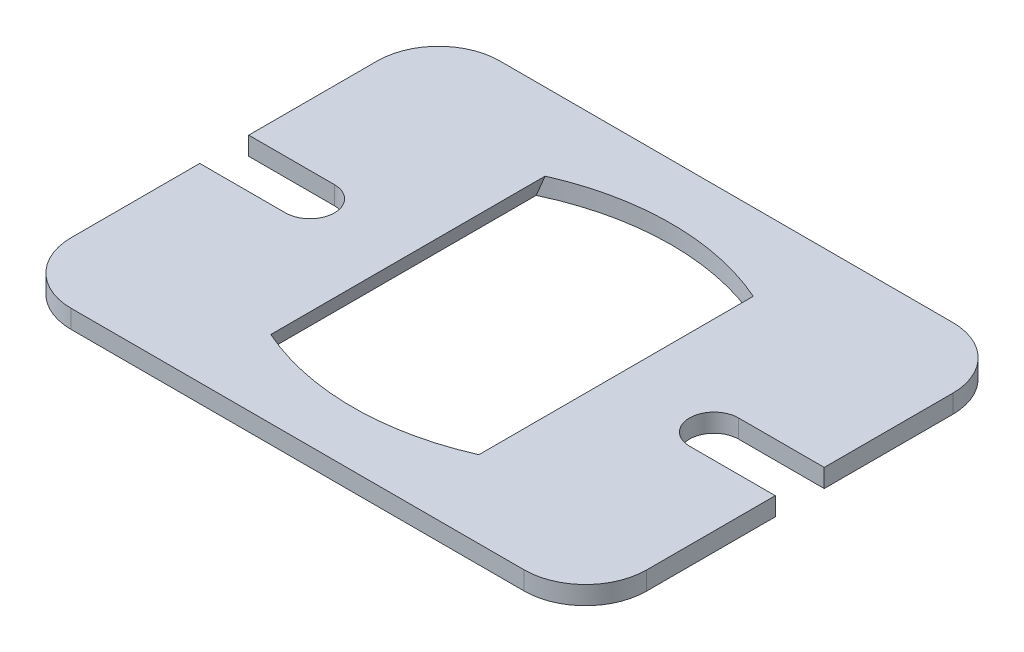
ISO-10303-21;
HEADER;
FILE_DESCRIPTION(('STEP AP214'),'2;1');
FILE_NAME('part.step','',(''),(''),'','','');
FILE_SCHEMA(('AUTOMOTIVE_DESIGN { 1 0 10303 214 1 1 1 1 }'));
ENDSEC;
DATA;
#1=APPLICATION_CONTEXT('core data for automotive mechanical design processes');
#2=APPLICATION_PROTOCOL_DEFINITION('international standard','automotive_design',2000,#1);
#3=PRODUCT_CONTEXT('',#1,'mechanical');
#4=PRODUCT('Part','Part','',(#3));
#5=PRODUCT_RELATED_PRODUCT_CATEGORY('part','',(#4));
#6=PRODUCT_DEFINITION_FORMATION('','',#4);
#7=PRODUCT_DEFINITION_CONTEXT('part definition',#1,'design');
#8=PRODUCT_DEFINITION('design','',#6,#7);
#9=PRODUCT_DEFINITION_SHAPE('','',#8);
#10=(LENGTH_UNIT() NAMED_UNIT(*) SI_UNIT(.MILLI.,.METRE.));
#11=(NAMED_UNIT(*) PLANE_ANGLE_UNIT() SI_UNIT($,.RADIAN.));
#12=(NAMED_UNIT(*) SI_UNIT($,.STERADIAN.) SOLID_ANGLE_UNIT());
#13=UNCERTAINTY_MEASURE_WITH_UNIT(LENGTH_MEASURE(1.E-05),#10,'distance_accuracy_value','');
#14=(GEOMETRIC_REPRESENTATION_CONTEXT(3) GLOBAL_UNCERTAINTY_ASSIGNED_CONTEXT((#13)) GLOBAL_UNIT_ASSIGNED_CONTEXT((#10,
#11,#12)) REPRESENTATION_CONTEXT('',''));
#15=CARTESIAN_POINT('',(0.,0.,0.));
#16=DIRECTION('',(0.,0.,1.));
#17=DIRECTION('',(1.,0.,0.));
#18=AXIS2_PLACEMENT_3D('',#15,#16,#17);
#19=CARTESIAN_POINT('',(14.,3.,-35.));
#20=DIRECTION('',(0.,1.,0.));
#21=DIRECTION('',(0.,0.,1.));
#22=AXIS2_PLACEMENT_3D('',#19,#20,#21);
#23=PLANE('',#22);
#24=DIRECTION('',(-1.,0.,0.));
#25=VECTOR('',#24,1.);
#26=CARTESIAN_POINT('',(0.,3.,-70.));
#27=LINE('',#26,#25);
#28=CARTESIAN_POINT('',(84.,3.,-70.));
#29=VERTEX_POINT('',#28);
#30=CARTESIAN_POINT('',(10.,3.,-70.));
#31=VERTEX_POINT('',#30);
#32=EDGE_CURVE('E332',#29,#31,#27,.T.);
#33=ORIENTED_EDGE('',*,*,#32,.T.);
#34=CARTESIAN_POINT('',(10.,3.,-60.));
#35=DIRECTION('',(0.,1.,0.));
#36=DIRECTION('',(0.,0.,1.));
#37=AXIS2_PLACEMENT_3D('',#34,#35,#36);
#38=CIRCLE('',#37,10.);
#39=CARTESIAN_POINT('',(0.,3.,-60.));
#40=VERTEX_POINT('',#39);
#41=EDGE_CURVE('E220',#31,#40,#38,.T.);
#42=ORIENTED_EDGE('',*,*,#41,.T.);
#43=DIRECTION('',(0.,0.,1.));
#44=VECTOR('',#43,1.);
#45=CARTESIAN_POINT('',(0.,3.,-39.));
#46=LINE('',#45,#44);
#47=CARTESIAN_POINT('',(0.,3.,-39.));
#48=VERTEX_POINT('',#47);
#49=EDGE_CURVE('E334',#40,#48,#46,.T.);
#50=ORIENTED_EDGE('',*,*,#49,.T.);
#51=DIRECTION('',(1.,0.,0.));
#52=VECTOR('',#51,1.);
#53=CARTESIAN_POINT('',(14.,3.,-39.));
#54=LINE('',#53,#52);
#55=CARTESIAN_POINT('',(14.,3.,-39.));
#56=VERTEX_POINT('',#55);
#57=EDGE_CURVE('E336',#48,#56,#54,.T.);
#58=ORIENTED_EDGE('',*,*,#57,.T.);
#59=CARTESIAN_POINT('',(14.,3.,-35.));
#60=DIRECTION('',(0.,-1.,0.));
#61=DIRECTION('',(0.,0.,1.));
#62=AXIS2_PLACEMENT_3D('',#59,#60,#61);
#63=CIRCLE('',#62,4.00000000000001);
#64=CARTESIAN_POINT('',(14.,3.,-31.));
#65=VERTEX_POINT('',#64);
#66=EDGE_CURVE('E338',#56,#65,#63,.T.);
#67=ORIENTED_EDGE('',*,*,#66,.T.);
#68=DIRECTION('',(-1.,0.,0.));
#69=VECTOR('',#68,1.);
#70=CARTESIAN_POINT('',(14.,3.,-31.));
#71=LINE('',#70,#69);
#72=CARTESIAN_POINT('',(0.,3.,-31.));
#73=VERTEX_POINT('',#72);
#74=EDGE_CURVE('E286',#65,#73,#71,.T.);
#75=ORIENTED_EDGE('',*,*,#74,.T.);
#76=DIRECTION('',(0.,0.,1.));
#77=VECTOR('',#76,1.);
#78=CARTESIAN_POINT('',(0.,3.,0.));
#79=LINE('',#78,#77);
#80=CARTESIAN_POINT('',(0.,3.,-10.));
#81=VERTEX_POINT('',#80);
#82=EDGE_CURVE('E242',#73,#81,#79,.T.);
#83=ORIENTED_EDGE('',*,*,#82,.T.);
#84=CARTESIAN_POINT('',(10.,3.,-10.));
#85=DIRECTION('',(0.,1.,0.));
#86=DIRECTION('',(0.,0.,1.));
#87=AXIS2_PLACEMENT_3D('',#84,#85,#86);
#88=CIRCLE('',#87,10.);
#89=CARTESIAN_POINT('',(10.,3.,0.));
#90=VERTEX_POINT('',#89);
#91=EDGE_CURVE('E215',#81,#90,#88,.T.);
#92=ORIENTED_EDGE('',*,*,#91,.T.);
#93=DIRECTION('',(1.,0.,0.));
#94=VECTOR('',#93,1.);
#95=CARTESIAN_POINT('',(0.,3.,0.));
#96=LINE('',#95,#94);
#97=CARTESIAN_POINT('',(84.,3.,0.));
#98=VERTEX_POINT('',#97);
#99=EDGE_CURVE('E233',#90,#98,#96,.T.);
#100=ORIENTED_EDGE('',*,*,#99,.T.);
#101=CARTESIAN_POINT('',(84.,3.,-10.));
#102=DIRECTION('',(0.,1.,0.));
#103=DIRECTION('',(0.,0.,1.));
#104=AXIS2_PLACEMENT_3D('',#101,#102,#103);
#105=CIRCLE('',#104,10.);
#106=CARTESIAN_POINT('',(94.,3.,-9.99999999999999));
#107=VERTEX_POINT('',#106);
#108=EDGE_CURVE('E54',#98,#107,#105,.T.);
#109=ORIENTED_EDGE('',*,*,#108,.T.);
#110=DIRECTION('',(0.,0.,-1.));
#111=VECTOR('',#110,1.);
#112=CARTESIAN_POINT('',(94.,3.,0.));
#113=LINE('',#112,#111);
#114=CARTESIAN_POINT('',(94.,3.,-31.));
#115=VERTEX_POINT('',#114);
#116=EDGE_CURVE('E241',#107,#115,#113,.T.);
#117=ORIENTED_EDGE('',*,*,#116,.T.);
#118=DIRECTION('',(-1.,0.,0.));
#119=VECTOR('',#118,1.);
#120=CARTESIAN_POINT('',(80.,3.,-31.));
#121=LINE('',#120,#119);
#122=CARTESIAN_POINT('',(80.,3.,-31.));
#123=VERTEX_POINT('',#122);
#124=EDGE_CURVE('E324',#115,#123,#121,.T.);
#125=ORIENTED_EDGE('',*,*,#124,.T.);
#126=CARTESIAN_POINT('',(80.,3.,-35.));
#127=DIRECTION('',(0.,-1.,0.));
#128=DIRECTION('',(0.,0.,1.));
#129=AXIS2_PLACEMENT_3D('',#126,#127,#128);
#130=CIRCLE('',#129,4.);
#131=CARTESIAN_POINT('',(80.,3.,-39.));
#132=VERTEX_POINT('',#131);
#133=EDGE_CURVE('E326',#123,#132,#130,.T.);
#134=ORIENTED_EDGE('',*,*,#133,.T.);
#135=DIRECTION('',(1.,0.,0.));
#136=VECTOR('',#135,1.);
#137=CARTESIAN_POINT('',(80.,3.,-39.));
#138=LINE('',#137,#136);
#139=CARTESIAN_POINT('',(94.,3.,-39.));
#140=VERTEX_POINT('',#139);
#141=EDGE_CURVE('E328',#132,#140,#138,.T.);
#142=ORIENTED_EDGE('',*,*,#141,.T.);
#143=DIRECTION('',(0.,0.,-1.));
#144=VECTOR('',#143,1.);
#145=CARTESIAN_POINT('',(94.,3.,-39.));
#146=LINE('',#145,#144);
#147=CARTESIAN_POINT('',(94.,3.,-60.));
#148=VERTEX_POINT('',#147);
#149=EDGE_CURVE('E330',#140,#148,#146,.T.);
#150=ORIENTED_EDGE('',*,*,#149,.T.);
#151=CARTESIAN_POINT('',(84.,3.,-60.));
#152=DIRECTION('',(0.,1.,0.));
#153=DIRECTION('',(0.,0.,1.));
#154=AXIS2_PLACEMENT_3D('',#151,#152,#153);
#155=CIRCLE('',#154,10.);
#156=EDGE_CURVE('E218',#148,#29,#155,.T.);
#157=ORIENTED_EDGE('',*,*,#156,.T.);
#158=EDGE_LOOP('',(#33,#42,#50,#58,#67,#75,#83,#92,#100,#109,#117,#125,#134,#142,#150,#157));
#159=FACE_BOUND('',#158,.T.);
#160=DIRECTION('',(0.,0.,1.));
#161=VECTOR('',#160,1.);
#162=CARTESIAN_POINT('',(30.,3.,-57.405728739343));
#163=LINE('',#162,#161);
#164=CARTESIAN_POINT('',(30.,3.,-57.405728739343));
#165=VERTEX_POINT('',#164);
#166=CARTESIAN_POINT('',(30.,3.,-12.594271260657));
#167=VERTEX_POINT('',#166);
#168=EDGE_CURVE('E181',#165,#167,#163,.T.);
#169=ORIENTED_EDGE('',*,*,#168,.F.);
#170=CARTESIAN_POINT('',(47.,3.,-19.));
#171=DIRECTION('',(0.,1.,0.));
#172=DIRECTION('',(0.,0.,1.));
#173=AXIS2_PLACEMENT_3D('',#170,#171,#172);
#174=CIRCLE('',#173,42.);
#175=CARTESIAN_POINT('',(64.,3.,-57.405728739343));
#176=VERTEX_POINT('',#175);
#177=EDGE_CURVE('E170',#176,#165,#174,.T.);
#178=ORIENTED_EDGE('',*,*,#177,.F.);
#179=DIRECTION('',(0.,0.,-1.));
#180=VECTOR('',#179,1.);
#181=CARTESIAN_POINT('',(64.,3.,-57.405728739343));
#182=LINE('',#181,#180);
#183=CARTESIAN_POINT('',(64.,3.,-12.594271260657));
#184=VERTEX_POINT('',#183);
#185=EDGE_CURVE('E341',#184,#176,#182,.T.);
#186=ORIENTED_EDGE('',*,*,#185,.F.);
#187=CARTESIAN_POINT('',(47.,3.,-51.));
#188=DIRECTION('',(0.,1.,0.));
#189=DIRECTION('',(0.,0.,1.));
#190=AXIS2_PLACEMENT_3D('',#187,#188,#189);
#191=CIRCLE('',#190,42.);
#192=EDGE_CURVE('E186',#167,#184,#191,.T.);
#193=ORIENTED_EDGE('',*,*,#192,.F.);
#194=EDGE_LOOP('',(#169,#178,#186,#193));
#195=FACE_BOUND('',#194,.T.);
#196=ADVANCED_FACE('F31',(#159,#195),#23,.T.);
#197=CARTESIAN_POINT('',(14.,0.,-35.));
#198=DIRECTION('',(0.,1.,0.));
#199=DIRECTION('',(0.,0.,1.));
#200=AXIS2_PLACEMENT_3D('',#197,#198,#199);
#201=PLANE('',#200);
#202=DIRECTION('',(0.,0.,1.));
#203=VECTOR('',#202,1.);
#204=CARTESIAN_POINT('',(0.,0.,-39.));
#205=LINE('',#204,#203);
#206=CARTESIAN_POINT('',(0.,0.,-60.));
#207=VERTEX_POINT('',#206);
#208=CARTESIAN_POINT('',(0.,0.,-39.));
#209=VERTEX_POINT('',#208);
#210=EDGE_CURVE('E274',#207,#209,#205,.T.);
#211=ORIENTED_EDGE('',*,*,#210,.F.);
#212=CARTESIAN_POINT('',(10.,0.,-60.));
#213=DIRECTION('',(0.,1.,0.));
#214=DIRECTION('',(0.,0.,1.));
#215=AXIS2_PLACEMENT_3D('',#212,#213,#214);
#216=CIRCLE('',#215,10.);
#217=CARTESIAN_POINT('',(10.,0.,-70.));
#218=VERTEX_POINT('',#217);
#219=EDGE_CURVE('E208',#207,#218,#216,.F.);
#220=ORIENTED_EDGE('',*,*,#219,.T.);
#221=DIRECTION('',(-1.,0.,0.));
#222=VECTOR('',#221,1.);
#223=CARTESIAN_POINT('',(0.,0.,-70.));
#224=LINE('',#223,#222);
#225=CARTESIAN_POINT('',(84.,0.,-70.));
#226=VERTEX_POINT('',#225);
#227=EDGE_CURVE('E271',#226,#218,#224,.T.);
#228=ORIENTED_EDGE('',*,*,#227,.F.);
#229=CARTESIAN_POINT('',(84.,0.,-60.));
#230=DIRECTION('',(0.,1.,0.));
#231=DIRECTION('',(0.,0.,1.));
#232=AXIS2_PLACEMENT_3D('',#229,#230,#231);
#233=CIRCLE('',#232,10.);
#234=CARTESIAN_POINT('',(94.,0.,-60.));
#235=VERTEX_POINT('',#234);
#236=EDGE_CURVE('E206',#226,#235,#233,.F.);
#237=ORIENTED_EDGE('',*,*,#236,.T.);
#238=DIRECTION('',(0.,0.,-1.));
#239=VECTOR('',#238,1.);
#240=CARTESIAN_POINT('',(94.,0.,-39.));
#241=LINE('',#240,#239);
#242=CARTESIAN_POINT('',(94.,0.,-39.));
#243=VERTEX_POINT('',#242);
#244=EDGE_CURVE('E269',#243,#235,#241,.T.);
#245=ORIENTED_EDGE('',*,*,#244,.F.);
#246=DIRECTION('',(1.,0.,0.));
#247=VECTOR('',#246,1.);
#248=CARTESIAN_POINT('',(80.,0.,-39.));
#249=LINE('',#248,#247);
#250=CARTESIAN_POINT('',(80.,0.,-39.));
#251=VERTEX_POINT('',#250);
#252=EDGE_CURVE('E267',#251,#243,#249,.T.);
#253=ORIENTED_EDGE('',*,*,#252,.F.);
#254=CARTESIAN_POINT('',(80.,0.,-35.));
#255=DIRECTION('',(0.,-1.,0.));
#256=DIRECTION('',(0.,0.,1.));
#257=AXIS2_PLACEMENT_3D('',#254,#255,#256);
#258=CIRCLE('',#257,4.);
#259=CARTESIAN_POINT('',(80.,0.,-31.));
#260=VERTEX_POINT('',#259);
#261=EDGE_CURVE('E260',#260,#251,#258,.T.);
#262=ORIENTED_EDGE('',*,*,#261,.F.);
#263=DIRECTION('',(-1.,0.,0.));
#264=VECTOR('',#263,1.);
#265=CARTESIAN_POINT('',(80.,0.,-31.));
#266=LINE('',#265,#264);
#267=CARTESIAN_POINT('',(94.,0.,-31.));
#268=VERTEX_POINT('',#267);
#269=EDGE_CURVE('E258',#268,#260,#266,.T.);
#270=ORIENTED_EDGE('',*,*,#269,.F.);
#271=DIRECTION('',(0.,0.,-1.));
#272=VECTOR('',#271,1.);
#273=CARTESIAN_POINT('',(94.,0.,0.));
#274=LINE('',#273,#272);
#275=CARTESIAN_POINT('',(94.,0.,-9.99999999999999));
#276=VERTEX_POINT('',#275);
#277=EDGE_CURVE('E250',#276,#268,#274,.T.);
#278=ORIENTED_EDGE('',*,*,#277,.F.);
#279=CARTESIAN_POINT('',(84.,0.,-10.));
#280=DIRECTION('',(0.,1.,0.));
#281=DIRECTION('',(0.,0.,1.));
#282=AXIS2_PLACEMENT_3D('',#279,#280,#281);
#283=CIRCLE('',#282,10.);
#284=CARTESIAN_POINT('',(84.,0.,0.));
#285=VERTEX_POINT('',#284);
#286=EDGE_CURVE('E204',#276,#285,#283,.F.);
#287=ORIENTED_EDGE('',*,*,#286,.T.);
#288=DIRECTION('',(1.,0.,0.));
#289=VECTOR('',#288,1.);
#290=CARTESIAN_POINT('',(0.,0.,0.));
#291=LINE('',#290,#289);
#292=CARTESIAN_POINT('',(10.,0.,0.));
#293=VERTEX_POINT('',#292);
#294=EDGE_CURVE('E236',#293,#285,#291,.T.);
#295=ORIENTED_EDGE('',*,*,#294,.F.);
#296=CARTESIAN_POINT('',(10.,0.,-10.));
#297=DIRECTION('',(0.,1.,0.));
#298=DIRECTION('',(0.,0.,1.));
#299=AXIS2_PLACEMENT_3D('',#296,#297,#298);
#300=CIRCLE('',#299,10.);
#301=CARTESIAN_POINT('',(0.,0.,-10.));
#302=VERTEX_POINT('',#301);
#303=EDGE_CURVE('E197',#293,#302,#300,.F.);
#304=ORIENTED_EDGE('',*,*,#303,.T.);
#305=DIRECTION('',(0.,0.,1.));
#306=VECTOR('',#305,1.);
#307=CARTESIAN_POINT('',(0.,0.,0.));
#308=LINE('',#307,#306);
#309=CARTESIAN_POINT('',(0.,0.,-31.));
#310=VERTEX_POINT('',#309);
#311=EDGE_CURVE('E262',#310,#302,#308,.T.);
#312=ORIENTED_EDGE('',*,*,#311,.F.);
#313=DIRECTION('',(-1.,0.,0.));
#314=VECTOR('',#313,1.);
#315=CARTESIAN_POINT('',(14.,0.,-31.));
#316=LINE('',#315,#314);
#317=CARTESIAN_POINT('',(14.,0.,-31.));
#318=VERTEX_POINT('',#317);
#319=EDGE_CURVE('E280',#318,#310,#316,.T.);
#320=ORIENTED_EDGE('',*,*,#319,.F.);
#321=CARTESIAN_POINT('',(14.,0.,-35.));
#322=DIRECTION('',(0.,-1.,0.));
#323=DIRECTION('',(0.,0.,1.));
#324=AXIS2_PLACEMENT_3D('',#321,#322,#323);
#325=CIRCLE('',#324,4.00000000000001);
#326=CARTESIAN_POINT('',(14.,0.,-39.));
#327=VERTEX_POINT('',#326);
#328=EDGE_CURVE('E278',#327,#318,#325,.T.);
#329=ORIENTED_EDGE('',*,*,#328,.F.);
#330=DIRECTION('',(1.,0.,0.));
#331=VECTOR('',#330,1.);
#332=CARTESIAN_POINT('',(14.,0.,-39.));
#333=LINE('',#332,#331);
#334=EDGE_CURVE('E276',#209,#327,#333,.T.);
#335=ORIENTED_EDGE('',*,*,#334,.F.);
#336=EDGE_LOOP('',(#211,#220,#228,#237,#245,#253,#262,#270,#278,#287,#295,#304,#312,#320,#329,#335));
#337=FACE_BOUND('',#336,.T.);
#338=DIRECTION('',(0.,0.,-1.));
#339=VECTOR('',#338,1.);
#340=CARTESIAN_POINT('',(65.,0.,-57.405728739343));
#341=LINE('',#340,#339);
#342=CARTESIAN_POINT('',(65.,0.,-13.0526680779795));
#343=VERTEX_POINT('',#342);
#344=CARTESIAN_POINT('',(65.,0.,-56.9473319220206));
#345=VERTEX_POINT('',#344);
#346=EDGE_CURVE('E307',#343,#345,#341,.T.);
#347=ORIENTED_EDGE('',*,*,#346,.T.);
#348=CARTESIAN_POINT('',(47.,0.,-19.));
#349=DIRECTION('',(0.,1.,0.));
#350=DIRECTION('',(0.,0.,1.));
#351=AXIS2_PLACEMENT_3D('',#348,#349,#350);
#352=CIRCLE('',#351,42.);
#353=CARTESIAN_POINT('',(29.,0.,-56.9473319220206));
#354=VERTEX_POINT('',#353);
#355=EDGE_CURVE('E317',#345,#354,#352,.T.);
#356=ORIENTED_EDGE('',*,*,#355,.T.);
#357=DIRECTION('',(0.,0.,1.));
#358=VECTOR('',#357,1.);
#359=CARTESIAN_POINT('',(29.,0.,-12.594271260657));
#360=LINE('',#359,#358);
#361=CARTESIAN_POINT('',(29.,0.,-13.0526680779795));
#362=VERTEX_POINT('',#361);
#363=EDGE_CURVE('E192',#354,#362,#360,.T.);
#364=ORIENTED_EDGE('',*,*,#363,.T.);
#365=CARTESIAN_POINT('',(47.,0.,-51.));
#366=DIRECTION('',(0.,1.,0.));
#367=DIRECTION('',(0.,0.,1.));
#368=AXIS2_PLACEMENT_3D('',#365,#366,#367);
#369=CIRCLE('',#368,42.);
#370=EDGE_CURVE('E182',#362,#343,#369,.T.);
#371=ORIENTED_EDGE('',*,*,#370,.T.);
#372=EDGE_LOOP('',(#347,#356,#364,#371));
#373=FACE_BOUND('',#372,.T.);
#374=ADVANCED_FACE('F255',(#337,#373),#201,.F.);
#375=CARTESIAN_POINT('',(0.,3.,0.));
#376=DIRECTION('',(1.,0.,0.));
#377=DIRECTION('',(0.,0.,-1.));
#378=AXIS2_PLACEMENT_3D('',#375,#376,#377);
#379=PLANE('',#378);
#380=ORIENTED_EDGE('',*,*,#311,.T.);
#381=DIRECTION('',(0.,-1.,0.));
#382=VECTOR('',#381,1.);
#383=CARTESIAN_POINT('',(0.,3.,-10.));
#384=LINE('',#383,#382);
#385=EDGE_CURVE('E11',#302,#81,#384,.F.);
#386=ORIENTED_EDGE('',*,*,#385,.T.);
#387=ORIENTED_EDGE('',*,*,#82,.F.);
#388=DIRECTION('',(0.,-1.,0.));
#389=VECTOR('',#388,1.);
#390=CARTESIAN_POINT('',(0.,3.,-31.));
#391=LINE('',#390,#389);
#392=EDGE_CURVE('E282',#73,#310,#391,.T.);
#393=ORIENTED_EDGE('',*,*,#392,.T.);
#394=EDGE_LOOP('',(#380,#386,#387,#393));
#395=FACE_BOUND('',#394,.T.);
#396=ADVANCED_FACE('F346',(#395),#379,.F.);
#397=CARTESIAN_POINT('',(0.,3.,0.));
#398=DIRECTION('',(0.,0.,-1.));
#399=DIRECTION('',(-1.,0.,0.));
#400=AXIS2_PLACEMENT_3D('',#397,#398,#399);
#401=PLANE('',#400);
#402=ORIENTED_EDGE('',*,*,#294,.T.);
#403=DIRECTION('',(0.,-1.,0.));
#404=VECTOR('',#403,1.);
#405=CARTESIAN_POINT('',(84.,3.,0.));
#406=LINE('',#405,#404);
#407=EDGE_CURVE('E39',#285,#98,#406,.F.);
#408=ORIENTED_EDGE('',*,*,#407,.T.);
#409=ORIENTED_EDGE('',*,*,#99,.F.);
#410=DIRECTION('',(0.,-1.,0.));
#411=VECTOR('',#410,1.);
#412=CARTESIAN_POINT('',(10.,3.,0.));
#413=LINE('',#412,#411);
#414=EDGE_CURVE('E226',#90,#293,#413,.T.);
#415=ORIENTED_EDGE('',*,*,#414,.T.);
#416=EDGE_LOOP('',(#402,#408,#409,#415));
#417=FACE_BOUND('',#416,.T.);
#418=ADVANCED_FACE('F232',(#417),#401,.F.);
#419=CARTESIAN_POINT('',(94.,3.,0.));
#420=DIRECTION('',(-1.,0.,0.));
#421=DIRECTION('',(0.,0.,1.));
#422=AXIS2_PLACEMENT_3D('',#419,#420,#421);
#423=PLANE('',#422);
#424=ORIENTED_EDGE('',*,*,#116,.F.);
#425=DIRECTION('',(0.,-1.,0.));
#426=VECTOR('',#425,1.);
#427=CARTESIAN_POINT('',(94.,3.,-9.99999999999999));
#428=LINE('',#427,#426);
#429=EDGE_CURVE('E223',#107,#276,#428,.T.);
#430=ORIENTED_EDGE('',*,*,#429,.T.);
#431=ORIENTED_EDGE('',*,*,#277,.T.);
#432=DIRECTION('',(0.,-1.,0.));
#433=VECTOR('',#432,1.);
#434=CARTESIAN_POINT('',(94.,3.,-31.));
#435=LINE('',#434,#433);
#436=EDGE_CURVE('E304',#115,#268,#435,.T.);
#437=ORIENTED_EDGE('',*,*,#436,.F.);
#438=EDGE_LOOP('',(#424,#430,#431,#437));
#439=FACE_BOUND('',#438,.T.);
#440=ADVANCED_FACE('F248',(#439),#423,.F.);
#441=CARTESIAN_POINT('',(80.,3.,-31.));
#442=DIRECTION('',(0.,0.,1.));
#443=DIRECTION('',(1.,0.,0.));
#444=AXIS2_PLACEMENT_3D('',#441,#442,#443);
#445=PLANE('',#444);
#446=ORIENTED_EDGE('',*,*,#269,.T.);
#447=DIRECTION('',(0.,-1.,0.));
#448=VECTOR('',#447,1.);
#449=CARTESIAN_POINT('',(80.,3.,-31.));
#450=LINE('',#449,#448);
#451=EDGE_CURVE('E301',#123,#260,#450,.T.);
#452=ORIENTED_EDGE('',*,*,#451,.F.);
#453=ORIENTED_EDGE('',*,*,#124,.F.);
#454=ORIENTED_EDGE('',*,*,#436,.T.);
#455=EDGE_LOOP('',(#446,#452,#453,#454));
#456=FACE_BOUND('',#455,.T.);
#457=ADVANCED_FACE('F395',(#456),#445,.F.);
#458=CARTESIAN_POINT('',(80.,3.,-35.));
#459=DIRECTION('',(0.,-1.,0.));
#460=DIRECTION('',(0.,0.,-1.));
#461=AXIS2_PLACEMENT_3D('',#458,#459,#460);
#462=CYLINDRICAL_SURFACE('',#461,4.);
#463=ORIENTED_EDGE('',*,*,#261,.T.);
#464=DIRECTION('',(0.,-1.,0.));
#465=VECTOR('',#464,1.);
#466=CARTESIAN_POINT('',(80.,3.,-39.));
#467=LINE('',#466,#465);
#468=EDGE_CURVE('E298',#132,#251,#467,.T.);
#469=ORIENTED_EDGE('',*,*,#468,.F.);
#470=ORIENTED_EDGE('',*,*,#133,.F.);
#471=ORIENTED_EDGE('',*,*,#451,.T.);
#472=EDGE_LOOP('',(#463,#469,#470,#471));
#473=FACE_BOUND('',#472,.T.);
#474=ADVANCED_FACE('F391',(#473),#462,.F.);
#475=CARTESIAN_POINT('',(80.,3.,-39.));
#476=DIRECTION('',(0.,0.,-1.));
#477=DIRECTION('',(-1.,0.,0.));
#478=AXIS2_PLACEMENT_3D('',#475,#476,#477);
#479=PLANE('',#478);
#480=ORIENTED_EDGE('',*,*,#252,.T.);
#481=DIRECTION('',(0.,-1.,0.));
#482=VECTOR('',#481,1.);
#483=CARTESIAN_POINT('',(94.,3.,-39.));
#484=LINE('',#483,#482);
#485=EDGE_CURVE('E295',#140,#243,#484,.T.);
#486=ORIENTED_EDGE('',*,*,#485,.F.);
#487=ORIENTED_EDGE('',*,*,#141,.F.);
#488=ORIENTED_EDGE('',*,*,#468,.T.);
#489=EDGE_LOOP('',(#480,#486,#487,#488));
#490=FACE_BOUND('',#489,.T.);
#491=ADVANCED_FACE('F388',(#490),#479,.F.);
#492=CARTESIAN_POINT('',(94.,3.,-39.));
#493=DIRECTION('',(-1.,0.,0.));
#494=DIRECTION('',(0.,0.,1.));
#495=AXIS2_PLACEMENT_3D('',#492,#493,#494);
#496=PLANE('',#495);
#497=ORIENTED_EDGE('',*,*,#244,.T.);
#498=DIRECTION('',(0.,-1.,0.));
#499=VECTOR('',#498,1.);
#500=CARTESIAN_POINT('',(94.,3.,-60.));
#501=LINE('',#500,#499);
#502=EDGE_CURVE('E46',#235,#148,#501,.F.);
#503=ORIENTED_EDGE('',*,*,#502,.T.);
#504=ORIENTED_EDGE('',*,*,#149,.F.);
#505=ORIENTED_EDGE('',*,*,#485,.T.);
#506=EDGE_LOOP('',(#497,#503,#504,#505));
#507=FACE_BOUND('',#506,.T.);
#508=ADVANCED_FACE('F384',(#507),#496,.F.);
#509=CARTESIAN_POINT('',(0.,3.,-70.));
#510=DIRECTION('',(0.,0.,1.));
#511=DIRECTION('',(1.,0.,0.));
#512=AXIS2_PLACEMENT_3D('',#509,#510,#511);
#513=PLANE('',#512);
#514=ORIENTED_EDGE('',*,*,#227,.T.);
#515=DIRECTION('',(0.,-1.,0.));
#516=VECTOR('',#515,1.);
#517=CARTESIAN_POINT('',(10.,3.,-70.));
#518=LINE('',#517,#516);
#519=EDGE_CURVE('E213',#218,#31,#518,.F.);
#520=ORIENTED_EDGE('',*,*,#519,.T.);
#521=ORIENTED_EDGE('',*,*,#32,.F.);
#522=DIRECTION('',(0.,-1.,0.));
#523=VECTOR('',#522,1.);
#524=CARTESIAN_POINT('',(84.,3.,-70.));
#525=LINE('',#524,#523);
#526=EDGE_CURVE('E210',#29,#226,#525,.T.);
#527=ORIENTED_EDGE('',*,*,#526,.T.);
#528=EDGE_LOOP('',(#514,#520,#521,#527));
#529=FACE_BOUND('',#528,.T.);
#530=ADVANCED_FACE('F380',(#529),#513,.F.);
#531=CARTESIAN_POINT('',(0.,3.,-39.));
#532=DIRECTION('',(1.,0.,0.));
#533=DIRECTION('',(0.,0.,-1.));
#534=AXIS2_PLACEMENT_3D('',#531,#532,#533);
#535=PLANE('',#534);
#536=ORIENTED_EDGE('',*,*,#49,.F.);
#537=DIRECTION('',(0.,-1.,0.));
#538=VECTOR('',#537,1.);
#539=CARTESIAN_POINT('',(0.,3.,-60.));
#540=LINE('',#539,#538);
#541=EDGE_CURVE('E193',#40,#207,#540,.T.);
#542=ORIENTED_EDGE('',*,*,#541,.T.);
#543=ORIENTED_EDGE('',*,*,#210,.T.);
#544=DIRECTION('',(0.,-1.,0.));
#545=VECTOR('',#544,1.);
#546=CARTESIAN_POINT('',(0.,3.,-39.));
#547=LINE('',#546,#545);
#548=EDGE_CURVE('E292',#48,#209,#547,.T.);
#549=ORIENTED_EDGE('',*,*,#548,.F.);
#550=EDGE_LOOP('',(#536,#542,#543,#549));
#551=FACE_BOUND('',#550,.T.);
#552=ADVANCED_FACE('F376',(#551),#535,.F.);
#553=CARTESIAN_POINT('',(14.,3.,-39.));
#554=DIRECTION('',(0.,0.,-1.));
#555=DIRECTION('',(-1.,0.,0.));
#556=AXIS2_PLACEMENT_3D('',#553,#554,#555);
#557=PLANE('',#556);
#558=ORIENTED_EDGE('',*,*,#334,.T.);
#559=DIRECTION('',(0.,-1.,0.));
#560=VECTOR('',#559,1.);
#561=CARTESIAN_POINT('',(14.,3.,-39.));
#562=LINE('',#561,#560);
#563=EDGE_CURVE('E289',#56,#327,#562,.T.);
#564=ORIENTED_EDGE('',*,*,#563,.F.);
#565=ORIENTED_EDGE('',*,*,#57,.F.);
#566=ORIENTED_EDGE('',*,*,#548,.T.);
#567=EDGE_LOOP('',(#558,#564,#565,#566));
#568=FACE_BOUND('',#567,.T.);
#569=ADVANCED_FACE('F372',(#568),#557,.F.);
#570=CARTESIAN_POINT('',(14.,3.,-35.));
#571=DIRECTION('',(0.,-1.,0.));
#572=DIRECTION('',(0.,0.,-1.));
#573=AXIS2_PLACEMENT_3D('',#570,#571,#572);
#574=CYLINDRICAL_SURFACE('',#573,4.00000000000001);
#575=ORIENTED_EDGE('',*,*,#328,.T.);
#576=DIRECTION('',(0.,-1.,0.));
#577=VECTOR('',#576,1.);
#578=CARTESIAN_POINT('',(14.,3.,-31.));
#579=LINE('',#578,#577);
#580=EDGE_CURVE('E285',#65,#318,#579,.T.);
#581=ORIENTED_EDGE('',*,*,#580,.F.);
#582=ORIENTED_EDGE('',*,*,#66,.F.);
#583=ORIENTED_EDGE('',*,*,#563,.T.);
#584=EDGE_LOOP('',(#575,#581,#582,#583));
#585=FACE_BOUND('',#584,.T.);
#586=ADVANCED_FACE('F368',(#585),#574,.F.);
#587=CARTESIAN_POINT('',(14.,3.,-31.));
#588=DIRECTION('',(0.,0.,1.));
#589=DIRECTION('',(1.,0.,0.));
#590=AXIS2_PLACEMENT_3D('',#587,#588,#589);
#591=PLANE('',#590);
#592=ORIENTED_EDGE('',*,*,#319,.T.);
#593=ORIENTED_EDGE('',*,*,#392,.F.);
#594=ORIENTED_EDGE('',*,*,#74,.F.);
#595=ORIENTED_EDGE('',*,*,#580,.T.);
#596=EDGE_LOOP('',(#592,#593,#594,#595));
#597=FACE_BOUND('',#596,.T.);
#598=ADVANCED_FACE('F365',(#597),#591,.F.);
#599=CARTESIAN_POINT('',(47.,3.,-19.));
#600=DIRECTION('',(0.,-1.,0.));
#601=DIRECTION('',(0.,0.,-1.));
#602=AXIS2_PLACEMENT_3D('',#599,#600,#601);
#603=CYLINDRICAL_SURFACE('',#602,42.);
#604=ORIENTED_EDGE('',*,*,#355,.F.);
#605=CARTESIAN_POINT('',(47.,54.0000000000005,-19.));
#606=DIRECTION('',(-0.948683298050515,-0.316227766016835,0.));
#607=DIRECTION('',(0.316227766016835,-0.948683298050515,0.));
#608=AXIS2_PLACEMENT_3D('',#605,#606,#607);
#609=ELLIPSE('',#608,132.815661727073,42.);
#610=EDGE_CURVE('E177',#345,#176,#609,.F.);
#611=ORIENTED_EDGE('',*,*,#610,.T.);
#612=ORIENTED_EDGE('',*,*,#177,.T.);
#613=CARTESIAN_POINT('',(47.,54.0000000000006,-19.));
#614=DIRECTION('',(0.948683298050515,-0.316227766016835,0.));
#615=DIRECTION('',(-0.316227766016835,-0.948683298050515,0.));
#616=AXIS2_PLACEMENT_3D('',#613,#614,#615);
#617=ELLIPSE('',#616,132.815661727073,42.);
#618=EDGE_CURVE('E174',#165,#354,#617,.F.);
#619=ORIENTED_EDGE('',*,*,#618,.T.);
#620=EDGE_LOOP('',(#604,#611,#612,#619));
#621=FACE_BOUND('',#620,.T.);
#622=ADVANCED_FACE('F172',(#621),#603,.F.);
#623=CARTESIAN_POINT('',(47.,3.,-51.));
#624=DIRECTION('',(0.,-1.,0.));
#625=DIRECTION('',(0.,0.,-1.));
#626=AXIS2_PLACEMENT_3D('',#623,#624,#625);
#627=CYLINDRICAL_SURFACE('',#626,42.);
#628=ORIENTED_EDGE('',*,*,#370,.F.);
#629=CARTESIAN_POINT('',(47.,54.0000000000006,-51.));
#630=DIRECTION('',(0.948683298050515,-0.316227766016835,0.));
#631=DIRECTION('',(-0.316227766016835,-0.948683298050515,0.));
#632=AXIS2_PLACEMENT_3D('',#629,#630,#631);
#633=ELLIPSE('',#632,132.815661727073,42.);
#634=EDGE_CURVE('E194',#362,#167,#633,.F.);
#635=ORIENTED_EDGE('',*,*,#634,.T.);
#636=ORIENTED_EDGE('',*,*,#192,.T.);
#637=CARTESIAN_POINT('',(47.,54.0000000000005,-51.));
#638=DIRECTION('',(-0.948683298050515,-0.316227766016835,0.));
#639=DIRECTION('',(0.316227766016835,-0.948683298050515,0.));
#640=AXIS2_PLACEMENT_3D('',#637,#638,#639);
#641=ELLIPSE('',#640,132.815661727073,42.);
#642=EDGE_CURVE('E199',#184,#343,#641,.F.);
#643=ORIENTED_EDGE('',*,*,#642,.T.);
#644=EDGE_LOOP('',(#628,#635,#636,#643));
#645=FACE_BOUND('',#644,.T.);
#646=ADVANCED_FACE('F314',(#645),#627,.F.);
#647=CARTESIAN_POINT('',(65.,0.,-35.));
#648=DIRECTION('',(-0.948683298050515,-0.316227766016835,0.));
#649=DIRECTION('',(0.316227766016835,-0.948683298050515,0.));
#650=AXIS2_PLACEMENT_3D('',#647,#648,#649);
#651=PLANE('',#650);
#652=ORIENTED_EDGE('',*,*,#642,.F.);
#653=ORIENTED_EDGE('',*,*,#185,.T.);
#654=ORIENTED_EDGE('',*,*,#610,.F.);
#655=ORIENTED_EDGE('',*,*,#346,.F.);
#656=EDGE_LOOP('',(#652,#653,#654,#655));
#657=FACE_BOUND('',#656,.T.);
#658=ADVANCED_FACE('F316',(#657),#651,.T.);
#659=CARTESIAN_POINT('',(29.,0.,-35.));
#660=DIRECTION('',(0.948683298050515,-0.316227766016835,0.));
#661=DIRECTION('',(0.316227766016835,0.948683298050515,0.));
#662=AXIS2_PLACEMENT_3D('',#659,#660,#661);
#663=PLANE('',#662);
#664=ORIENTED_EDGE('',*,*,#618,.F.);
#665=ORIENTED_EDGE('',*,*,#168,.T.);
#666=ORIENTED_EDGE('',*,*,#634,.F.);
#667=ORIENTED_EDGE('',*,*,#363,.F.);
#668=EDGE_LOOP('',(#664,#665,#666,#667));
#669=FACE_BOUND('',#668,.T.);
#670=ADVANCED_FACE('F190',(#669),#663,.T.);
#671=CARTESIAN_POINT('',(10.,3.,-60.));
#672=DIRECTION('',(0.,-1.,0.));
#673=DIRECTION('',(0.,0.,-1.));
#674=AXIS2_PLACEMENT_3D('',#671,#672,#673);
#675=CYLINDRICAL_SURFACE('',#674,10.);
#676=ORIENTED_EDGE('',*,*,#41,.F.);
#677=ORIENTED_EDGE('',*,*,#519,.F.);
#678=ORIENTED_EDGE('',*,*,#219,.F.);
#679=ORIENTED_EDGE('',*,*,#541,.F.);
#680=EDGE_LOOP('',(#676,#677,#678,#679));
#681=FACE_BOUND('',#680,.T.);
#682=ADVANCED_FACE('F410',(#681),#675,.T.);
#683=CARTESIAN_POINT('',(84.,3.,-60.));
#684=DIRECTION('',(0.,-1.,0.));
#685=DIRECTION('',(0.,0.,-1.));
#686=AXIS2_PLACEMENT_3D('',#683,#684,#685);
#687=CYLINDRICAL_SURFACE('',#686,10.);
#688=ORIENTED_EDGE('',*,*,#156,.F.);
#689=ORIENTED_EDGE('',*,*,#502,.F.);
#690=ORIENTED_EDGE('',*,*,#236,.F.);
#691=ORIENTED_EDGE('',*,*,#526,.F.);
#692=EDGE_LOOP('',(#688,#689,#690,#691));
#693=FACE_BOUND('',#692,.T.);
#694=ADVANCED_FACE('F355',(#693),#687,.T.);
#695=CARTESIAN_POINT('',(84.,3.,-10.));
#696=DIRECTION('',(0.,-1.,0.));
#697=DIRECTION('',(0.,0.,-1.));
#698=AXIS2_PLACEMENT_3D('',#695,#696,#697);
#699=CYLINDRICAL_SURFACE('',#698,10.);
#700=ORIENTED_EDGE('',*,*,#108,.F.);
#701=ORIENTED_EDGE('',*,*,#407,.F.);
#702=ORIENTED_EDGE('',*,*,#286,.F.);
#703=ORIENTED_EDGE('',*,*,#429,.F.);
#704=EDGE_LOOP('',(#700,#701,#702,#703));
#705=FACE_BOUND('',#704,.T.);
#706=ADVANCED_FACE('F245',(#705),#699,.T.);
#707=CARTESIAN_POINT('',(10.,3.,-10.));
#708=DIRECTION('',(0.,-1.,0.));
#709=DIRECTION('',(0.,0.,-1.));
#710=AXIS2_PLACEMENT_3D('',#707,#708,#709);
#711=CYLINDRICAL_SURFACE('',#710,10.);
#712=ORIENTED_EDGE('',*,*,#91,.F.);
#713=ORIENTED_EDGE('',*,*,#385,.F.);
#714=ORIENTED_EDGE('',*,*,#303,.F.);
#715=ORIENTED_EDGE('',*,*,#414,.F.);
#716=EDGE_LOOP('',(#712,#713,#714,#715));
#717=FACE_BOUND('',#716,.T.);
#718=ADVANCED_FACE('F33',(#717),#711,.T.);
#719=CLOSED_SHELL('',(#196,#374,#396,#418,#440,#457,#474,#491,#508,#530,#552,#569,#586,#598,
#622,#646,#658,#670,#682,#694,#706,#718));
#720=MANIFOLD_SOLID_BREP('B2',#719);
#721=ADVANCED_BREP_SHAPE_REPRESENTATION('',(#18,#720),#14);
#722=SHAPE_DEFINITION_REPRESENTATION(#9,#721);
ENDSEC;
END-ISO-10303-21;
